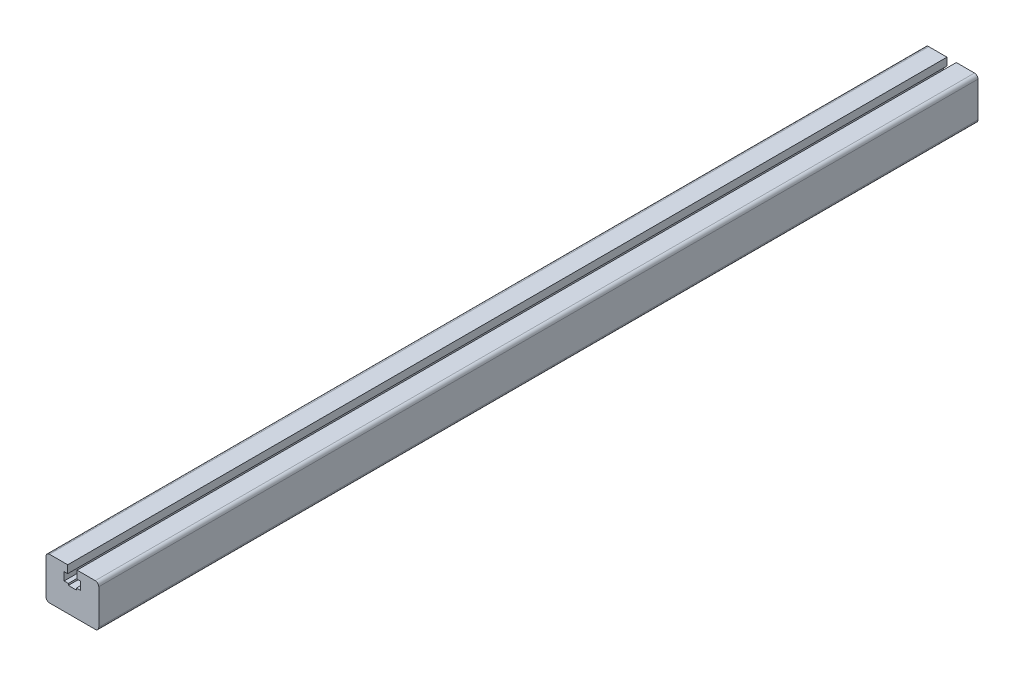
ISO-10303-21;
HEADER;
FILE_DESCRIPTION(('STEP AP214'),'2;1');
FILE_NAME('part.step','',(''),(''),'','','');
FILE_SCHEMA(('AUTOMOTIVE_DESIGN { 1 0 10303 214 1 1 1 1 }'));
ENDSEC;
DATA;
#1=APPLICATION_CONTEXT('core data for automotive mechanical design processes');
#2=APPLICATION_PROTOCOL_DEFINITION('international standard','automotive_design',2000,#1);
#3=PRODUCT_CONTEXT('',#1,'mechanical');
#4=PRODUCT('Part','Part','',(#3));
#5=PRODUCT_RELATED_PRODUCT_CATEGORY('part','',(#4));
#6=PRODUCT_DEFINITION_FORMATION('','',#4);
#7=PRODUCT_DEFINITION_CONTEXT('part definition',#1,'design');
#8=PRODUCT_DEFINITION('design','',#6,#7);
#9=PRODUCT_DEFINITION_SHAPE('','',#8);
#10=(LENGTH_UNIT() NAMED_UNIT(*) SI_UNIT(.MILLI.,.METRE.));
#11=(NAMED_UNIT(*) PLANE_ANGLE_UNIT() SI_UNIT($,.RADIAN.));
#12=(NAMED_UNIT(*) SI_UNIT($,.STERADIAN.) SOLID_ANGLE_UNIT());
#13=UNCERTAINTY_MEASURE_WITH_UNIT(LENGTH_MEASURE(1.E-05),#10,'distance_accuracy_value','');
#14=(GEOMETRIC_REPRESENTATION_CONTEXT(3) GLOBAL_UNCERTAINTY_ASSIGNED_CONTEXT((#13)) GLOBAL_UNIT_ASSIGNED_CONTEXT((#10,
#11,#12)) REPRESENTATION_CONTEXT('',''));
#15=CARTESIAN_POINT('',(0.,0.,0.));
#16=DIRECTION('',(0.,0.,1.));
#17=DIRECTION('',(1.,0.,0.));
#18=AXIS2_PLACEMENT_3D('',#15,#16,#17);
#19=CARTESIAN_POINT('',(-4.69999999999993,15.,500.));
#20=DIRECTION('',(0.,1.,0.));
#21=DIRECTION('',(1.,0.,0.));
#22=AXIS2_PLACEMENT_3D('',#19,#20,#21);
#23=PLANE('',#22);
#24=DIRECTION('',(0.,0.,1.));
#25=VECTOR('',#24,1.);
#26=CARTESIAN_POINT('',(-2.3,15.,500.));
#27=LINE('',#26,#25);
#28=CARTESIAN_POINT('',(-2.3,15.,0.));
#29=VERTEX_POINT('',#28);
#30=CARTESIAN_POINT('',(-2.3,15.,500.));
#31=VERTEX_POINT('',#30);
#32=EDGE_CURVE('E177',#29,#31,#27,.T.);
#33=ORIENTED_EDGE('',*,*,#32,.F.);
#34=DIRECTION('',(1.,0.,0.));
#35=VECTOR('',#34,1.);
#36=CARTESIAN_POINT('',(-4.69999999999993,15.,0.));
#37=LINE('',#36,#35);
#38=CARTESIAN_POINT('',(-4.69999999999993,15.,0.));
#39=VERTEX_POINT('',#38);
#40=EDGE_CURVE('E196',#39,#29,#37,.T.);
#41=ORIENTED_EDGE('',*,*,#40,.F.);
#42=DIRECTION('',(0.,0.,-1.));
#43=VECTOR('',#42,1.);
#44=CARTESIAN_POINT('',(-4.69999999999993,15.,500.));
#45=LINE('',#44,#43);
#46=CARTESIAN_POINT('',(-4.69999999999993,15.,500.));
#47=VERTEX_POINT('',#46);
#48=EDGE_CURVE('E234',#47,#39,#45,.T.);
#49=ORIENTED_EDGE('',*,*,#48,.F.);
#50=DIRECTION('',(1.,0.,0.));
#51=VECTOR('',#50,1.);
#52=CARTESIAN_POINT('',(-4.69999999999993,15.,500.));
#53=LINE('',#52,#51);
#54=EDGE_CURVE('E274',#47,#31,#53,.T.);
#55=ORIENTED_EDGE('',*,*,#54,.T.);
#56=EDGE_LOOP('',(#33,#41,#49,#55));
#57=FACE_BOUND('',#56,.T.);
#58=ADVANCED_FACE('F14',(#57),#23,.T.);
#59=CARTESIAN_POINT('',(-13.,2.,500.));
#60=DIRECTION('',(0.,0.,-1.));
#61=DIRECTION('',(-1.,0.,0.));
#62=AXIS2_PLACEMENT_3D('',#59,#60,#61);
#63=CYLINDRICAL_SURFACE('',#62,2.);
#64=CARTESIAN_POINT('',(-13.,2.,0.));
#65=DIRECTION('',(0.,0.,-1.));
#66=DIRECTION('',(-1.,0.,0.));
#67=AXIS2_PLACEMENT_3D('',#64,#65,#66);
#68=CIRCLE('',#67,2.);
#69=CARTESIAN_POINT('',(-13.,0.,0.));
#70=VERTEX_POINT('',#69);
#71=CARTESIAN_POINT('',(-15.,2.,0.));
#72=VERTEX_POINT('',#71);
#73=EDGE_CURVE('E173',#70,#72,#68,.T.);
#74=ORIENTED_EDGE('',*,*,#73,.F.);
#75=DIRECTION('',(0.,0.,-1.));
#76=VECTOR('',#75,1.);
#77=CARTESIAN_POINT('',(-13.,0.,500.));
#78=LINE('',#77,#76);
#79=CARTESIAN_POINT('',(-13.,0.,500.));
#80=VERTEX_POINT('',#79);
#81=EDGE_CURVE('E22',#80,#70,#78,.T.);
#82=ORIENTED_EDGE('',*,*,#81,.F.);
#83=CARTESIAN_POINT('',(-13.,2.,500.));
#84=DIRECTION('',(0.,0.,-1.));
#85=DIRECTION('',(-1.,0.,0.));
#86=AXIS2_PLACEMENT_3D('',#83,#84,#85);
#87=CIRCLE('',#86,2.);
#88=CARTESIAN_POINT('',(-15.,2.,500.));
#89=VERTEX_POINT('',#88);
#90=EDGE_CURVE('E217',#80,#89,#87,.T.);
#91=ORIENTED_EDGE('',*,*,#90,.T.);
#92=DIRECTION('',(0.,0.,-1.));
#93=VECTOR('',#92,1.);
#94=CARTESIAN_POINT('',(-15.,2.,500.));
#95=LINE('',#94,#93);
#96=EDGE_CURVE('E100',#89,#72,#95,.T.);
#97=ORIENTED_EDGE('',*,*,#96,.T.);
#98=EDGE_LOOP('',(#74,#82,#91,#97));
#99=FACE_BOUND('',#98,.T.);
#100=ADVANCED_FACE('F16',(#99),#63,.T.);
#101=CARTESIAN_POINT('',(-13.,0.,500.));
#102=DIRECTION('',(0.,1.,0.));
#103=DIRECTION('',(0.,0.,-1.));
#104=AXIS2_PLACEMENT_3D('',#101,#102,#103);
#105=PLANE('',#104);
#106=DIRECTION('',(1.,0.,0.));
#107=VECTOR('',#106,1.);
#108=CARTESIAN_POINT('',(-13.,0.,0.));
#109=LINE('',#108,#107);
#110=CARTESIAN_POINT('',(13.,0.,0.));
#111=VERTEX_POINT('',#110);
#112=EDGE_CURVE('E215',#70,#111,#109,.T.);
#113=ORIENTED_EDGE('',*,*,#112,.T.);
#114=DIRECTION('',(0.,0.,-1.));
#115=VECTOR('',#114,1.);
#116=CARTESIAN_POINT('',(13.,0.,500.));
#117=LINE('',#116,#115);
#118=CARTESIAN_POINT('',(13.,0.,500.));
#119=VERTEX_POINT('',#118);
#120=EDGE_CURVE('E153',#119,#111,#117,.T.);
#121=ORIENTED_EDGE('',*,*,#120,.F.);
#122=DIRECTION('',(1.,0.,0.));
#123=VECTOR('',#122,1.);
#124=CARTESIAN_POINT('',(-13.,0.,500.));
#125=LINE('',#124,#123);
#126=EDGE_CURVE('E167',#80,#119,#125,.T.);
#127=ORIENTED_EDGE('',*,*,#126,.F.);
#128=ORIENTED_EDGE('',*,*,#81,.T.);
#129=EDGE_LOOP('',(#113,#121,#127,#128));
#130=FACE_BOUND('',#129,.T.);
#131=ADVANCED_FACE('F250',(#130),#105,.F.);
#132=CARTESIAN_POINT('',(13.,2.,500.));
#133=DIRECTION('',(0.,0.,-1.));
#134=DIRECTION('',(-1.,0.,0.));
#135=AXIS2_PLACEMENT_3D('',#132,#133,#134);
#136=CYLINDRICAL_SURFACE('',#135,2.);
#137=CARTESIAN_POINT('',(13.,2.,0.));
#138=DIRECTION('',(0.,0.,-1.));
#139=DIRECTION('',(-1.,0.,0.));
#140=AXIS2_PLACEMENT_3D('',#137,#138,#139);
#141=CIRCLE('',#140,2.);
#142=CARTESIAN_POINT('',(15.,2.,0.));
#143=VERTEX_POINT('',#142);
#144=EDGE_CURVE('E149',#143,#111,#141,.T.);
#145=ORIENTED_EDGE('',*,*,#144,.F.);
#146=DIRECTION('',(0.,0.,-1.));
#147=VECTOR('',#146,1.);
#148=CARTESIAN_POINT('',(15.,2.,500.));
#149=LINE('',#148,#147);
#150=CARTESIAN_POINT('',(15.,2.,500.));
#151=VERTEX_POINT('',#150);
#152=EDGE_CURVE('E143',#151,#143,#149,.T.);
#153=ORIENTED_EDGE('',*,*,#152,.F.);
#154=CARTESIAN_POINT('',(13.,2.,500.));
#155=DIRECTION('',(0.,0.,-1.));
#156=DIRECTION('',(-1.,0.,0.));
#157=AXIS2_PLACEMENT_3D('',#154,#155,#156);
#158=CIRCLE('',#157,2.);
#159=EDGE_CURVE('E147',#151,#119,#158,.T.);
#160=ORIENTED_EDGE('',*,*,#159,.T.);
#161=ORIENTED_EDGE('',*,*,#120,.T.);
#162=EDGE_LOOP('',(#145,#153,#160,#161));
#163=FACE_BOUND('',#162,.T.);
#164=ADVANCED_FACE('F145',(#163),#136,.T.);
#165=CARTESIAN_POINT('',(15.,2.,500.));
#166=DIRECTION('',(-1.,0.,0.));
#167=DIRECTION('',(0.,0.,1.));
#168=AXIS2_PLACEMENT_3D('',#165,#166,#167);
#169=PLANE('',#168);
#170=DIRECTION('',(0.,1.,0.));
#171=VECTOR('',#170,1.);
#172=CARTESIAN_POINT('',(15.,2.,0.));
#173=LINE('',#172,#171);
#174=CARTESIAN_POINT('',(15.,22.,0.));
#175=VERTEX_POINT('',#174);
#176=EDGE_CURVE('E212',#143,#175,#173,.T.);
#177=ORIENTED_EDGE('',*,*,#176,.T.);
#178=DIRECTION('',(0.,0.,-1.));
#179=VECTOR('',#178,1.);
#180=CARTESIAN_POINT('',(15.,22.,500.));
#181=LINE('',#180,#179);
#182=CARTESIAN_POINT('',(15.,22.,500.));
#183=VERTEX_POINT('',#182);
#184=EDGE_CURVE('E154',#183,#175,#181,.T.);
#185=ORIENTED_EDGE('',*,*,#184,.F.);
#186=DIRECTION('',(0.,1.,0.));
#187=VECTOR('',#186,1.);
#188=CARTESIAN_POINT('',(15.,2.,500.));
#189=LINE('',#188,#187);
#190=EDGE_CURVE('E157',#151,#183,#189,.T.);
#191=ORIENTED_EDGE('',*,*,#190,.F.);
#192=ORIENTED_EDGE('',*,*,#152,.T.);
#193=EDGE_LOOP('',(#177,#185,#191,#192));
#194=FACE_BOUND('',#193,.T.);
#195=ADVANCED_FACE('F158',(#194),#169,.F.);
#196=CARTESIAN_POINT('',(13.,22.,500.));
#197=DIRECTION('',(0.,0.,-1.));
#198=DIRECTION('',(-1.,0.,0.));
#199=AXIS2_PLACEMENT_3D('',#196,#197,#198);
#200=CYLINDRICAL_SURFACE('',#199,2.);
#201=CARTESIAN_POINT('',(13.,22.,0.));
#202=DIRECTION('',(0.,0.,-1.));
#203=DIRECTION('',(-1.,0.,0.));
#204=AXIS2_PLACEMENT_3D('',#201,#202,#203);
#205=CIRCLE('',#204,2.);
#206=CARTESIAN_POINT('',(13.,24.,0.));
#207=VERTEX_POINT('',#206);
#208=EDGE_CURVE('E209',#207,#175,#205,.T.);
#209=ORIENTED_EDGE('',*,*,#208,.F.);
#210=DIRECTION('',(0.,0.,-1.));
#211=VECTOR('',#210,1.);
#212=CARTESIAN_POINT('',(13.,24.,500.));
#213=LINE('',#212,#211);
#214=CARTESIAN_POINT('',(13.,24.,500.));
#215=VERTEX_POINT('',#214);
#216=EDGE_CURVE('E221',#215,#207,#213,.T.);
#217=ORIENTED_EDGE('',*,*,#216,.F.);
#218=CARTESIAN_POINT('',(13.,22.,500.));
#219=DIRECTION('',(0.,0.,-1.));
#220=DIRECTION('',(-1.,0.,0.));
#221=AXIS2_PLACEMENT_3D('',#218,#219,#220);
#222=CIRCLE('',#221,2.);
#223=EDGE_CURVE('E162',#215,#183,#222,.T.);
#224=ORIENTED_EDGE('',*,*,#223,.T.);
#225=ORIENTED_EDGE('',*,*,#184,.T.);
#226=EDGE_LOOP('',(#209,#217,#224,#225));
#227=FACE_BOUND('',#226,.T.);
#228=ADVANCED_FACE('F288',(#227),#200,.T.);
#229=CARTESIAN_POINT('',(2.64999999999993,24.,500.));
#230=DIRECTION('',(0.,1.,0.));
#231=DIRECTION('',(0.,0.,-1.));
#232=AXIS2_PLACEMENT_3D('',#229,#230,#231);
#233=PLANE('',#232);
#234=DIRECTION('',(1.,0.,0.));
#235=VECTOR('',#234,1.);
#236=CARTESIAN_POINT('',(2.64999999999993,24.,0.));
#237=LINE('',#236,#235);
#238=CARTESIAN_POINT('',(2.64999999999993,24.,0.));
#239=VERTEX_POINT('',#238);
#240=EDGE_CURVE('E206',#239,#207,#237,.T.);
#241=ORIENTED_EDGE('',*,*,#240,.F.);
#242=DIRECTION('',(0.,0.,-1.));
#243=VECTOR('',#242,1.);
#244=CARTESIAN_POINT('',(2.64999999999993,24.,500.));
#245=LINE('',#244,#243);
#246=CARTESIAN_POINT('',(2.64999999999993,24.,500.));
#247=VERTEX_POINT('',#246);
#248=EDGE_CURVE('E223',#247,#239,#245,.T.);
#249=ORIENTED_EDGE('',*,*,#248,.F.);
#250=DIRECTION('',(1.,0.,0.));
#251=VECTOR('',#250,1.);
#252=CARTESIAN_POINT('',(2.64999999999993,24.,500.));
#253=LINE('',#252,#251);
#254=EDGE_CURVE('E284',#247,#215,#253,.T.);
#255=ORIENTED_EDGE('',*,*,#254,.T.);
#256=ORIENTED_EDGE('',*,*,#216,.T.);
#257=EDGE_LOOP('',(#241,#249,#255,#256));
#258=FACE_BOUND('',#257,.T.);
#259=ADVANCED_FACE('F292',(#258),#233,.T.);
#260=CARTESIAN_POINT('',(2.64999999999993,24.,500.));
#261=DIRECTION('',(1.,0.,0.));
#262=DIRECTION('',(0.,0.,-1.));
#263=AXIS2_PLACEMENT_3D('',#260,#261,#262);
#264=PLANE('',#263);
#265=DIRECTION('',(0.,-1.,0.));
#266=VECTOR('',#265,1.);
#267=CARTESIAN_POINT('',(2.64999999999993,24.,0.));
#268=LINE('',#267,#266);
#269=CARTESIAN_POINT('',(2.64999999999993,19.6,0.));
#270=VERTEX_POINT('',#269);
#271=EDGE_CURVE('E204',#239,#270,#268,.T.);
#272=ORIENTED_EDGE('',*,*,#271,.T.);
#273=DIRECTION('',(0.,0.,-1.));
#274=VECTOR('',#273,1.);
#275=CARTESIAN_POINT('',(2.64999999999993,19.6,500.));
#276=LINE('',#275,#274);
#277=CARTESIAN_POINT('',(2.64999999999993,19.6,500.));
#278=VERTEX_POINT('',#277);
#279=EDGE_CURVE('E225',#278,#270,#276,.T.);
#280=ORIENTED_EDGE('',*,*,#279,.F.);
#281=DIRECTION('',(0.,-1.,0.));
#282=VECTOR('',#281,1.);
#283=CARTESIAN_POINT('',(2.64999999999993,24.,500.));
#284=LINE('',#283,#282);
#285=EDGE_CURVE('E282',#247,#278,#284,.T.);
#286=ORIENTED_EDGE('',*,*,#285,.F.);
#287=ORIENTED_EDGE('',*,*,#248,.T.);
#288=EDGE_LOOP('',(#272,#280,#286,#287));
#289=FACE_BOUND('',#288,.T.);
#290=ADVANCED_FACE('F297',(#289),#264,.F.);
#291=CARTESIAN_POINT('',(2.64999999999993,19.6,500.));
#292=DIRECTION('',(0.,1.,0.));
#293=DIRECTION('',(1.,0.,0.));
#294=AXIS2_PLACEMENT_3D('',#291,#292,#293);
#295=PLANE('',#294);
#296=DIRECTION('',(1.,0.,0.));
#297=VECTOR('',#296,1.);
#298=CARTESIAN_POINT('',(2.64999999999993,19.6,0.));
#299=LINE('',#298,#297);
#300=CARTESIAN_POINT('',(4.69999999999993,19.6,0.));
#301=VERTEX_POINT('',#300);
#302=EDGE_CURVE('E202',#270,#301,#299,.T.);
#303=ORIENTED_EDGE('',*,*,#302,.T.);
#304=DIRECTION('',(0.,0.,-1.));
#305=VECTOR('',#304,1.);
#306=CARTESIAN_POINT('',(4.69999999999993,19.6,500.));
#307=LINE('',#306,#305);
#308=CARTESIAN_POINT('',(4.69999999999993,19.6,500.));
#309=VERTEX_POINT('',#308);
#310=EDGE_CURVE('E228',#309,#301,#307,.T.);
#311=ORIENTED_EDGE('',*,*,#310,.F.);
#312=DIRECTION('',(1.,0.,0.));
#313=VECTOR('',#312,1.);
#314=CARTESIAN_POINT('',(2.64999999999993,19.6,500.));
#315=LINE('',#314,#313);
#316=EDGE_CURVE('E280',#278,#309,#315,.T.);
#317=ORIENTED_EDGE('',*,*,#316,.F.);
#318=ORIENTED_EDGE('',*,*,#279,.T.);
#319=EDGE_LOOP('',(#303,#311,#317,#318));
#320=FACE_BOUND('',#319,.T.);
#321=ADVANCED_FACE('F304',(#320),#295,.F.);
#322=CARTESIAN_POINT('',(4.69999999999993,19.6,500.));
#323=DIRECTION('',(1.,0.,0.));
#324=DIRECTION('',(0.,0.,-1.));
#325=AXIS2_PLACEMENT_3D('',#322,#323,#324);
#326=PLANE('',#325);
#327=DIRECTION('',(0.,-1.,0.));
#328=VECTOR('',#327,1.);
#329=CARTESIAN_POINT('',(4.69999999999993,19.6,0.));
#330=LINE('',#329,#328);
#331=CARTESIAN_POINT('',(4.69999999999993,15.,0.));
#332=VERTEX_POINT('',#331);
#333=EDGE_CURVE('E199',#301,#332,#330,.T.);
#334=ORIENTED_EDGE('',*,*,#333,.T.);
#335=DIRECTION('',(0.,0.,-1.));
#336=VECTOR('',#335,1.);
#337=CARTESIAN_POINT('',(4.69999999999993,15.,500.));
#338=LINE('',#337,#336);
#339=CARTESIAN_POINT('',(4.69999999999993,15.,500.));
#340=VERTEX_POINT('',#339);
#341=EDGE_CURVE('E231',#340,#332,#338,.T.);
#342=ORIENTED_EDGE('',*,*,#341,.F.);
#343=DIRECTION('',(0.,-1.,0.));
#344=VECTOR('',#343,1.);
#345=CARTESIAN_POINT('',(4.69999999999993,19.6,500.));
#346=LINE('',#345,#344);
#347=EDGE_CURVE('E277',#309,#340,#346,.T.);
#348=ORIENTED_EDGE('',*,*,#347,.F.);
#349=ORIENTED_EDGE('',*,*,#310,.T.);
#350=EDGE_LOOP('',(#334,#342,#348,#349));
#351=FACE_BOUND('',#350,.T.);
#352=ADVANCED_FACE('F308',(#351),#326,.F.);
#353=DIRECTION('',(0.,0.,-1.));
#354=VECTOR('',#353,1.);
#355=CARTESIAN_POINT('',(2.3,15.,500.));
#356=LINE('',#355,#354);
#357=CARTESIAN_POINT('',(2.3,15.,500.));
#358=VERTEX_POINT('',#357);
#359=CARTESIAN_POINT('',(2.3,15.,0.));
#360=VERTEX_POINT('',#359);
#361=EDGE_CURVE('E315',#358,#360,#356,.T.);
#362=ORIENTED_EDGE('',*,*,#361,.F.);
#363=EDGE_CURVE('E273',#358,#340,#53,.T.);
#364=ORIENTED_EDGE('',*,*,#363,.T.);
#365=ORIENTED_EDGE('',*,*,#341,.T.);
#366=EDGE_CURVE('E195',#360,#332,#37,.T.);
#367=ORIENTED_EDGE('',*,*,#366,.F.);
#368=EDGE_LOOP('',(#362,#364,#365,#367));
#369=FACE_BOUND('',#368,.T.);
#370=ADVANCED_FACE('F312',(#369),#23,.T.);
#371=CARTESIAN_POINT('',(-4.69999999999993,19.6,500.));
#372=DIRECTION('',(1.,0.,0.));
#373=DIRECTION('',(0.,0.,-1.));
#374=AXIS2_PLACEMENT_3D('',#371,#372,#373);
#375=PLANE('',#374);
#376=DIRECTION('',(0.,-1.,0.));
#377=VECTOR('',#376,1.);
#378=CARTESIAN_POINT('',(-4.69999999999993,19.6,0.));
#379=LINE('',#378,#377);
#380=CARTESIAN_POINT('',(-4.69999999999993,19.6,0.));
#381=VERTEX_POINT('',#380);
#382=EDGE_CURVE('E192',#381,#39,#379,.T.);
#383=ORIENTED_EDGE('',*,*,#382,.F.);
#384=DIRECTION('',(0.,0.,-1.));
#385=VECTOR('',#384,1.);
#386=CARTESIAN_POINT('',(-4.69999999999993,19.6,500.));
#387=LINE('',#386,#385);
#388=CARTESIAN_POINT('',(-4.69999999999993,19.6,500.));
#389=VERTEX_POINT('',#388);
#390=EDGE_CURVE('E236',#389,#381,#387,.T.);
#391=ORIENTED_EDGE('',*,*,#390,.F.);
#392=DIRECTION('',(0.,-1.,0.));
#393=VECTOR('',#392,1.);
#394=CARTESIAN_POINT('',(-4.69999999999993,19.6,500.));
#395=LINE('',#394,#393);
#396=EDGE_CURVE('E270',#389,#47,#395,.T.);
#397=ORIENTED_EDGE('',*,*,#396,.T.);
#398=ORIENTED_EDGE('',*,*,#48,.T.);
#399=EDGE_LOOP('',(#383,#391,#397,#398));
#400=FACE_BOUND('',#399,.T.);
#401=ADVANCED_FACE('F344',(#400),#375,.T.);
#402=CARTESIAN_POINT('',(-2.64999999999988,19.6,500.));
#403=DIRECTION('',(0.,-1.,0.));
#404=DIRECTION('',(-1.,0.,0.));
#405=AXIS2_PLACEMENT_3D('',#402,#403,#404);
#406=PLANE('',#405);
#407=DIRECTION('',(-1.,0.,0.));
#408=VECTOR('',#407,1.);
#409=CARTESIAN_POINT('',(-2.64999999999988,19.6,0.));
#410=LINE('',#409,#408);
#411=CARTESIAN_POINT('',(-2.64999999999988,19.6,0.));
#412=VERTEX_POINT('',#411);
#413=EDGE_CURVE('E189',#412,#381,#410,.T.);
#414=ORIENTED_EDGE('',*,*,#413,.F.);
#415=DIRECTION('',(0.,0.,-1.));
#416=VECTOR('',#415,1.);
#417=CARTESIAN_POINT('',(-2.64999999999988,19.6,500.));
#418=LINE('',#417,#416);
#419=CARTESIAN_POINT('',(-2.64999999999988,19.6,500.));
#420=VERTEX_POINT('',#419);
#421=EDGE_CURVE('E238',#420,#412,#418,.T.);
#422=ORIENTED_EDGE('',*,*,#421,.F.);
#423=DIRECTION('',(-1.,0.,0.));
#424=VECTOR('',#423,1.);
#425=CARTESIAN_POINT('',(-2.64999999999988,19.6,500.));
#426=LINE('',#425,#424);
#427=EDGE_CURVE('E267',#420,#389,#426,.T.);
#428=ORIENTED_EDGE('',*,*,#427,.T.);
#429=ORIENTED_EDGE('',*,*,#390,.T.);
#430=EDGE_LOOP('',(#414,#422,#428,#429));
#431=FACE_BOUND('',#430,.T.);
#432=ADVANCED_FACE('F383',(#431),#406,.T.);
#433=CARTESIAN_POINT('',(-2.64999999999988,24.,500.));
#434=DIRECTION('',(1.,0.,0.));
#435=DIRECTION('',(0.,0.,-1.));
#436=AXIS2_PLACEMENT_3D('',#433,#434,#435);
#437=PLANE('',#436);
#438=DIRECTION('',(0.,-1.,0.));
#439=VECTOR('',#438,1.);
#440=CARTESIAN_POINT('',(-2.64999999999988,24.,0.));
#441=LINE('',#440,#439);
#442=CARTESIAN_POINT('',(-2.64999999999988,24.,0.));
#443=VERTEX_POINT('',#442);
#444=EDGE_CURVE('E186',#443,#412,#441,.T.);
#445=ORIENTED_EDGE('',*,*,#444,.F.);
#446=DIRECTION('',(0.,0.,-1.));
#447=VECTOR('',#446,1.);
#448=CARTESIAN_POINT('',(-2.64999999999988,24.,500.));
#449=LINE('',#448,#447);
#450=CARTESIAN_POINT('',(-2.64999999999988,24.,500.));
#451=VERTEX_POINT('',#450);
#452=EDGE_CURVE('E240',#451,#443,#449,.T.);
#453=ORIENTED_EDGE('',*,*,#452,.F.);
#454=DIRECTION('',(0.,-1.,0.));
#455=VECTOR('',#454,1.);
#456=CARTESIAN_POINT('',(-2.64999999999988,24.,500.));
#457=LINE('',#456,#455);
#458=EDGE_CURVE('E264',#451,#420,#457,.T.);
#459=ORIENTED_EDGE('',*,*,#458,.T.);
#460=ORIENTED_EDGE('',*,*,#421,.T.);
#461=EDGE_LOOP('',(#445,#453,#459,#460));
#462=FACE_BOUND('',#461,.T.);
#463=ADVANCED_FACE('F499',(#462),#437,.T.);
#464=CARTESIAN_POINT('',(-13.,24.,500.));
#465=DIRECTION('',(0.,1.,0.));
#466=DIRECTION('',(0.,0.,-1.));
#467=AXIS2_PLACEMENT_3D('',#464,#465,#466);
#468=PLANE('',#467);
#469=DIRECTION('',(1.,0.,0.));
#470=VECTOR('',#469,1.);
#471=CARTESIAN_POINT('',(-13.,24.,0.));
#472=LINE('',#471,#470);
#473=CARTESIAN_POINT('',(-13.,24.,0.));
#474=VERTEX_POINT('',#473);
#475=EDGE_CURVE('E183',#474,#443,#472,.T.);
#476=ORIENTED_EDGE('',*,*,#475,.F.);
#477=DIRECTION('',(0.,0.,-1.));
#478=VECTOR('',#477,1.);
#479=CARTESIAN_POINT('',(-13.,24.,500.));
#480=LINE('',#479,#478);
#481=CARTESIAN_POINT('',(-13.,24.,500.));
#482=VERTEX_POINT('',#481);
#483=EDGE_CURVE('E242',#482,#474,#480,.T.);
#484=ORIENTED_EDGE('',*,*,#483,.F.);
#485=DIRECTION('',(1.,0.,0.));
#486=VECTOR('',#485,1.);
#487=CARTESIAN_POINT('',(-13.,24.,500.));
#488=LINE('',#487,#486);
#489=EDGE_CURVE('E261',#482,#451,#488,.T.);
#490=ORIENTED_EDGE('',*,*,#489,.T.);
#491=ORIENTED_EDGE('',*,*,#452,.T.);
#492=EDGE_LOOP('',(#476,#484,#490,#491));
#493=FACE_BOUND('',#492,.T.);
#494=ADVANCED_FACE('F504',(#493),#468,.T.);
#495=CARTESIAN_POINT('',(-13.,22.,500.));
#496=DIRECTION('',(0.,0.,-1.));
#497=DIRECTION('',(-1.,0.,0.));
#498=AXIS2_PLACEMENT_3D('',#495,#496,#497);
#499=CYLINDRICAL_SURFACE('',#498,2.);
#500=CARTESIAN_POINT('',(-13.,22.,0.));
#501=DIRECTION('',(0.,0.,-1.));
#502=DIRECTION('',(-1.,0.,0.));
#503=AXIS2_PLACEMENT_3D('',#500,#501,#502);
#504=CIRCLE('',#503,2.);
#505=CARTESIAN_POINT('',(-15.,22.,0.));
#506=VERTEX_POINT('',#505);
#507=EDGE_CURVE('E180',#506,#474,#504,.T.);
#508=ORIENTED_EDGE('',*,*,#507,.F.);
#509=DIRECTION('',(0.,0.,-1.));
#510=VECTOR('',#509,1.);
#511=CARTESIAN_POINT('',(-15.,22.,500.));
#512=LINE('',#511,#510);
#513=CARTESIAN_POINT('',(-15.,22.,500.));
#514=VERTEX_POINT('',#513);
#515=EDGE_CURVE('E244',#514,#506,#512,.T.);
#516=ORIENTED_EDGE('',*,*,#515,.F.);
#517=CARTESIAN_POINT('',(-13.,22.,500.));
#518=DIRECTION('',(0.,0.,-1.));
#519=DIRECTION('',(-1.,0.,0.));
#520=AXIS2_PLACEMENT_3D('',#517,#518,#519);
#521=CIRCLE('',#520,2.);
#522=EDGE_CURVE('E254',#514,#482,#521,.T.);
#523=ORIENTED_EDGE('',*,*,#522,.T.);
#524=ORIENTED_EDGE('',*,*,#483,.T.);
#525=EDGE_LOOP('',(#508,#516,#523,#524));
#526=FACE_BOUND('',#525,.T.);
#527=ADVANCED_FACE('F520',(#526),#499,.T.);
#528=CARTESIAN_POINT('',(-15.,2.,500.));
#529=DIRECTION('',(-1.,0.,0.));
#530=DIRECTION('',(0.,0.,1.));
#531=AXIS2_PLACEMENT_3D('',#528,#529,#530);
#532=PLANE('',#531);
#533=DIRECTION('',(0.,1.,0.));
#534=VECTOR('',#533,1.);
#535=CARTESIAN_POINT('',(-15.,2.,0.));
#536=LINE('',#535,#534);
#537=EDGE_CURVE('E176',#72,#506,#536,.T.);
#538=ORIENTED_EDGE('',*,*,#537,.F.);
#539=ORIENTED_EDGE('',*,*,#96,.F.);
#540=DIRECTION('',(0.,1.,0.));
#541=VECTOR('',#540,1.);
#542=CARTESIAN_POINT('',(-15.,2.,500.));
#543=LINE('',#542,#541);
#544=EDGE_CURVE('E252',#89,#514,#543,.T.);
#545=ORIENTED_EDGE('',*,*,#544,.T.);
#546=ORIENTED_EDGE('',*,*,#515,.T.);
#547=EDGE_LOOP('',(#538,#539,#545,#546));
#548=FACE_BOUND('',#547,.T.);
#549=ADVANCED_FACE('F245',(#548),#532,.T.);
#550=CARTESIAN_POINT('',(-13.,2.,500.));
#551=DIRECTION('',(0.,0.,-1.));
#552=DIRECTION('',(-1.,0.,0.));
#553=AXIS2_PLACEMENT_3D('',#550,#551,#552);
#554=PLANE('',#553);
#555=DIRECTION('',(1.,0.,0.));
#556=VECTOR('',#555,1.);
#557=CARTESIAN_POINT('',(-2.3,14.,500.));
#558=LINE('',#557,#556);
#559=CARTESIAN_POINT('',(-2.3,14.,500.));
#560=VERTEX_POINT('',#559);
#561=CARTESIAN_POINT('',(2.3,14.,500.));
#562=VERTEX_POINT('',#561);
#563=EDGE_CURVE('E350',#560,#562,#558,.T.);
#564=ORIENTED_EDGE('',*,*,#563,.F.);
#565=DIRECTION('',(0.,-1.,0.));
#566=VECTOR('',#565,1.);
#567=CARTESIAN_POINT('',(-2.3,16.3676859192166,500.));
#568=LINE('',#567,#566);
#569=EDGE_CURVE('E347',#31,#560,#568,.T.);
#570=ORIENTED_EDGE('',*,*,#569,.F.);
#571=ORIENTED_EDGE('',*,*,#54,.F.);
#572=ORIENTED_EDGE('',*,*,#396,.F.);
#573=ORIENTED_EDGE('',*,*,#427,.F.);
#574=ORIENTED_EDGE('',*,*,#458,.F.);
#575=ORIENTED_EDGE('',*,*,#489,.F.);
#576=ORIENTED_EDGE('',*,*,#522,.F.);
#577=ORIENTED_EDGE('',*,*,#544,.F.);
#578=ORIENTED_EDGE('',*,*,#90,.F.);
#579=ORIENTED_EDGE('',*,*,#126,.T.);
#580=ORIENTED_EDGE('',*,*,#159,.F.);
#581=ORIENTED_EDGE('',*,*,#190,.T.);
#582=ORIENTED_EDGE('',*,*,#223,.F.);
#583=ORIENTED_EDGE('',*,*,#254,.F.);
#584=ORIENTED_EDGE('',*,*,#285,.T.);
#585=ORIENTED_EDGE('',*,*,#316,.T.);
#586=ORIENTED_EDGE('',*,*,#347,.T.);
#587=ORIENTED_EDGE('',*,*,#363,.F.);
#588=DIRECTION('',(0.,1.,0.));
#589=VECTOR('',#588,1.);
#590=CARTESIAN_POINT('',(2.3,16.3676859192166,500.));
#591=LINE('',#590,#589);
#592=EDGE_CURVE('E319',#562,#358,#591,.T.);
#593=ORIENTED_EDGE('',*,*,#592,.F.);
#594=EDGE_LOOP('',(#564,#570,#571,#572,#573,#574,#575,#576,#577,#578,#579,#580,#581,#582,#583,
#584,#585,#586,#587,#593));
#595=FACE_BOUND('',#594,.T.);
#596=ADVANCED_FACE('F165',(#595),#554,.F.);
#597=CARTESIAN_POINT('',(-13.,2.,0.));
#598=DIRECTION('',(0.,0.,-1.));
#599=DIRECTION('',(-1.,0.,0.));
#600=AXIS2_PLACEMENT_3D('',#597,#598,#599);
#601=PLANE('',#600);
#602=DIRECTION('',(0.,1.,0.));
#603=VECTOR('',#602,1.);
#604=CARTESIAN_POINT('',(-2.3,2.,0.));
#605=LINE('',#604,#603);
#606=CARTESIAN_POINT('',(-2.3,14.,0.));
#607=VERTEX_POINT('',#606);
#608=EDGE_CURVE('E9',#607,#29,#605,.T.);
#609=ORIENTED_EDGE('',*,*,#608,.F.);
#610=DIRECTION('',(1.,0.,0.));
#611=VECTOR('',#610,1.);
#612=CARTESIAN_POINT('',(-2.3,14.,0.));
#613=LINE('',#612,#611);
#614=CARTESIAN_POINT('',(2.3,14.,0.));
#615=VERTEX_POINT('',#614);
#616=EDGE_CURVE('E357',#607,#615,#613,.T.);
#617=ORIENTED_EDGE('',*,*,#616,.T.);
#618=DIRECTION('',(0.,1.,0.));
#619=VECTOR('',#618,1.);
#620=CARTESIAN_POINT('',(2.3,16.3676859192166,0.));
#621=LINE('',#620,#619);
#622=EDGE_CURVE('E29',#615,#360,#621,.T.);
#623=ORIENTED_EDGE('',*,*,#622,.T.);
#624=ORIENTED_EDGE('',*,*,#366,.T.);
#625=ORIENTED_EDGE('',*,*,#333,.F.);
#626=ORIENTED_EDGE('',*,*,#302,.F.);
#627=ORIENTED_EDGE('',*,*,#271,.F.);
#628=ORIENTED_EDGE('',*,*,#240,.T.);
#629=ORIENTED_EDGE('',*,*,#208,.T.);
#630=ORIENTED_EDGE('',*,*,#176,.F.);
#631=ORIENTED_EDGE('',*,*,#144,.T.);
#632=ORIENTED_EDGE('',*,*,#112,.F.);
#633=ORIENTED_EDGE('',*,*,#73,.T.);
#634=ORIENTED_EDGE('',*,*,#537,.T.);
#635=ORIENTED_EDGE('',*,*,#507,.T.);
#636=ORIENTED_EDGE('',*,*,#475,.T.);
#637=ORIENTED_EDGE('',*,*,#444,.T.);
#638=ORIENTED_EDGE('',*,*,#413,.T.);
#639=ORIENTED_EDGE('',*,*,#382,.T.);
#640=ORIENTED_EDGE('',*,*,#40,.T.);
#641=EDGE_LOOP('',(#609,#617,#623,#624,#625,#626,#627,#628,#629,#630,#631,#632,#633,#634,#635,
#636,#637,#638,#639,#640));
#642=FACE_BOUND('',#641,.T.);
#643=ADVANCED_FACE('F249',(#642),#601,.T.);
#644=CARTESIAN_POINT('',(-2.3,16.3676859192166,0.));
#645=DIRECTION('',(-1.,0.,0.));
#646=DIRECTION('',(0.,-1.,0.));
#647=AXIS2_PLACEMENT_3D('',#644,#645,#646);
#648=PLANE('',#647);
#649=ORIENTED_EDGE('',*,*,#32,.T.);
#650=ORIENTED_EDGE('',*,*,#569,.T.);
#651=DIRECTION('',(0.,0.,1.));
#652=VECTOR('',#651,1.);
#653=CARTESIAN_POINT('',(-2.3,14.,0.));
#654=LINE('',#653,#652);
#655=EDGE_CURVE('E335',#607,#560,#654,.T.);
#656=ORIENTED_EDGE('',*,*,#655,.F.);
#657=ORIENTED_EDGE('',*,*,#608,.T.);
#658=EDGE_LOOP('',(#649,#650,#656,#657));
#659=FACE_BOUND('',#658,.T.);
#660=ADVANCED_FACE('F333',(#659),#648,.F.);
#661=CARTESIAN_POINT('',(2.3,16.3676859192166,0.));
#662=DIRECTION('',(1.,0.,0.));
#663=DIRECTION('',(0.,1.,0.));
#664=AXIS2_PLACEMENT_3D('',#661,#662,#663);
#665=PLANE('',#664);
#666=ORIENTED_EDGE('',*,*,#361,.T.);
#667=ORIENTED_EDGE('',*,*,#622,.F.);
#668=DIRECTION('',(0.,0.,1.));
#669=VECTOR('',#668,1.);
#670=CARTESIAN_POINT('',(2.3,14.,0.));
#671=LINE('',#670,#669);
#672=EDGE_CURVE('E358',#615,#562,#671,.T.);
#673=ORIENTED_EDGE('',*,*,#672,.T.);
#674=ORIENTED_EDGE('',*,*,#592,.T.);
#675=EDGE_LOOP('',(#666,#667,#673,#674));
#676=FACE_BOUND('',#675,.T.);
#677=ADVANCED_FACE('F360',(#676),#665,.F.);
#678=CARTESIAN_POINT('',(-2.3,14.,0.));
#679=DIRECTION('',(0.,-1.,0.));
#680=DIRECTION('',(1.,0.,0.));
#681=AXIS2_PLACEMENT_3D('',#678,#679,#680);
#682=PLANE('',#681);
#683=ORIENTED_EDGE('',*,*,#563,.T.);
#684=ORIENTED_EDGE('',*,*,#672,.F.);
#685=ORIENTED_EDGE('',*,*,#616,.F.);
#686=ORIENTED_EDGE('',*,*,#655,.T.);
#687=EDGE_LOOP('',(#683,#684,#685,#686));
#688=FACE_BOUND('',#687,.T.);
#689=ADVANCED_FACE('F362',(#688),#682,.F.);
#690=CLOSED_SHELL('',(#58,#100,#131,#164,#195,#228,#259,#290,#321,#352,#370,#401,#432,#463,#494,
#527,#549,#596,#643,#660,#677,#689));
#691=MANIFOLD_SOLID_BREP('B1',#690);
#692=ADVANCED_BREP_SHAPE_REPRESENTATION('',(#18,#691),#14);
#693=SHAPE_DEFINITION_REPRESENTATION(#9,#692);
ENDSEC;
END-ISO-10303-21;
